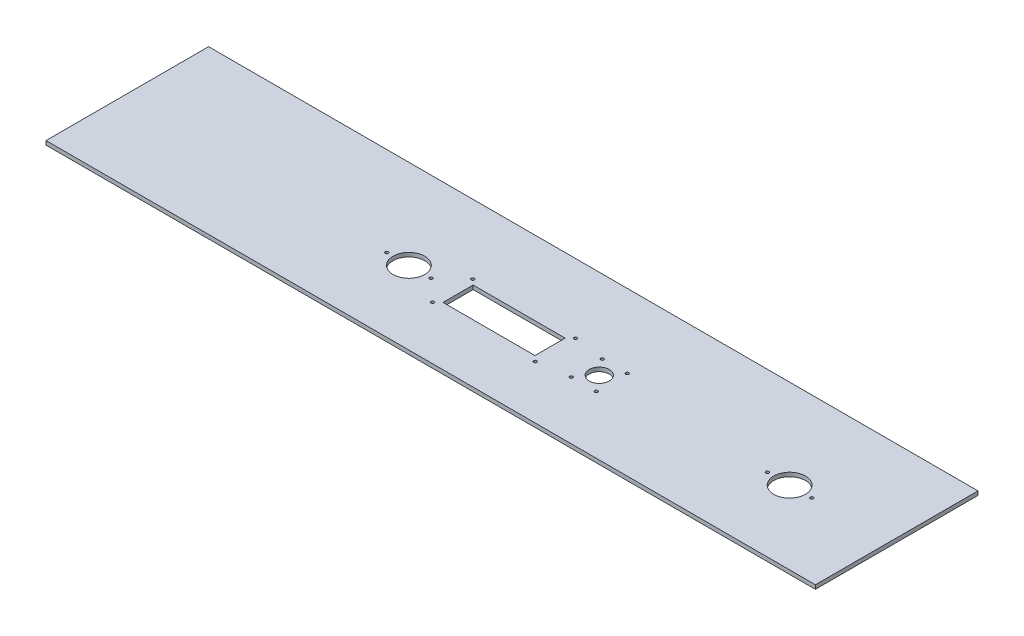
ISO-10303-21;
HEADER;
FILE_DESCRIPTION(('STEP AP214'),'2;1');
FILE_NAME('part.step','',(''),(''),'','','');
FILE_SCHEMA(('AUTOMOTIVE_DESIGN { 1 0 10303 214 1 1 1 1 }'));
ENDSEC;
DATA;
#1=APPLICATION_CONTEXT('core data for automotive mechanical design processes');
#2=APPLICATION_PROTOCOL_DEFINITION('international standard','automotive_design',2000,#1);
#3=PRODUCT_CONTEXT('',#1,'mechanical');
#4=PRODUCT('Part','Part','',(#3));
#5=PRODUCT_RELATED_PRODUCT_CATEGORY('part','',(#4));
#6=PRODUCT_DEFINITION_FORMATION('','',#4);
#7=PRODUCT_DEFINITION_CONTEXT('part definition',#1,'design');
#8=PRODUCT_DEFINITION('design','',#6,#7);
#9=PRODUCT_DEFINITION_SHAPE('','',#8);
#10=(LENGTH_UNIT() NAMED_UNIT(*) SI_UNIT(.MILLI.,.METRE.));
#11=(NAMED_UNIT(*) PLANE_ANGLE_UNIT() SI_UNIT($,.RADIAN.));
#12=(NAMED_UNIT(*) SI_UNIT($,.STERADIAN.) SOLID_ANGLE_UNIT());
#13=UNCERTAINTY_MEASURE_WITH_UNIT(LENGTH_MEASURE(1.E-05),#10,'distance_accuracy_value','');
#14=(GEOMETRIC_REPRESENTATION_CONTEXT(3) GLOBAL_UNCERTAINTY_ASSIGNED_CONTEXT((#13)) GLOBAL_UNIT_ASSIGNED_CONTEXT((#10,
#11,#12)) REPRESENTATION_CONTEXT('',''));
#15=CARTESIAN_POINT('',(0.,0.,0.));
#16=DIRECTION('',(0.,0.,1.));
#17=DIRECTION('',(1.,0.,0.));
#18=AXIS2_PLACEMENT_3D('',#15,#16,#17);
#19=CARTESIAN_POINT('',(307.975,3.175,65.0875));
#20=DIRECTION('',(-1.,0.,0.));
#21=DIRECTION('',(0.,0.,1.));
#22=AXIS2_PLACEMENT_3D('',#19,#20,#21);
#23=PLANE('',#22);
#24=DIRECTION('',(0.,0.,-1.));
#25=VECTOR('',#24,1.);
#26=CARTESIAN_POINT('',(307.975,0.,65.0875));
#27=LINE('',#26,#25);
#28=CARTESIAN_POINT('',(307.975,0.,65.0875));
#29=VERTEX_POINT('',#28);
#30=CARTESIAN_POINT('',(307.975,0.,-65.0875));
#31=VERTEX_POINT('',#30);
#32=EDGE_CURVE('E158',#29,#31,#27,.T.);
#33=ORIENTED_EDGE('',*,*,#32,.T.);
#34=DIRECTION('',(0.,-1.,0.));
#35=VECTOR('',#34,1.);
#36=CARTESIAN_POINT('',(307.975,3.175,-65.0875));
#37=LINE('',#36,#35);
#38=CARTESIAN_POINT('',(307.975,3.175,-65.0875));
#39=VERTEX_POINT('',#38);
#40=EDGE_CURVE('E12',#39,#31,#37,.T.);
#41=ORIENTED_EDGE('',*,*,#40,.F.);
#42=DIRECTION('',(0.,0.,-1.));
#43=VECTOR('',#42,1.);
#44=CARTESIAN_POINT('',(307.975,3.175,65.0875));
#45=LINE('',#44,#43);
#46=CARTESIAN_POINT('',(307.975,3.175,65.0875));
#47=VERTEX_POINT('',#46);
#48=EDGE_CURVE('E162',#47,#39,#45,.T.);
#49=ORIENTED_EDGE('',*,*,#48,.F.);
#50=DIRECTION('',(0.,-1.,0.));
#51=VECTOR('',#50,1.);
#52=CARTESIAN_POINT('',(307.975,3.175,65.0875));
#53=LINE('',#52,#51);
#54=EDGE_CURVE('E179',#47,#29,#53,.T.);
#55=ORIENTED_EDGE('',*,*,#54,.T.);
#56=EDGE_LOOP('',(#33,#41,#49,#55));
#57=FACE_BOUND('',#56,.T.);
#58=ADVANCED_FACE('F46',(#57),#23,.F.);
#59=CARTESIAN_POINT('',(-307.975,3.175,-65.0875));
#60=DIRECTION('',(0.,0.,1.));
#61=DIRECTION('',(1.,0.,0.));
#62=AXIS2_PLACEMENT_3D('',#59,#60,#61);
#63=PLANE('',#62);
#64=DIRECTION('',(-1.,0.,0.));
#65=VECTOR('',#64,1.);
#66=CARTESIAN_POINT('',(-307.975,0.,-65.0875));
#67=LINE('',#66,#65);
#68=CARTESIAN_POINT('',(-307.975,0.,-65.0875));
#69=VERTEX_POINT('',#68);
#70=EDGE_CURVE('E182',#31,#69,#67,.T.);
#71=ORIENTED_EDGE('',*,*,#70,.T.);
#72=DIRECTION('',(0.,-1.,0.));
#73=VECTOR('',#72,1.);
#74=CARTESIAN_POINT('',(-307.975,3.175,-65.0875));
#75=LINE('',#74,#73);
#76=CARTESIAN_POINT('',(-307.975,3.175,-65.0875));
#77=VERTEX_POINT('',#76);
#78=EDGE_CURVE('E53',#77,#69,#75,.T.);
#79=ORIENTED_EDGE('',*,*,#78,.F.);
#80=DIRECTION('',(-1.,0.,0.));
#81=VECTOR('',#80,1.);
#82=CARTESIAN_POINT('',(-307.975,3.175,-65.0875));
#83=LINE('',#82,#81);
#84=EDGE_CURVE('E167',#39,#77,#83,.T.);
#85=ORIENTED_EDGE('',*,*,#84,.F.);
#86=ORIENTED_EDGE('',*,*,#40,.T.);
#87=EDGE_LOOP('',(#71,#79,#85,#86));
#88=FACE_BOUND('',#87,.T.);
#89=ADVANCED_FACE('F367',(#88),#63,.F.);
#90=CARTESIAN_POINT('',(-307.975,3.175,65.0875));
#91=DIRECTION('',(1.,0.,0.));
#92=DIRECTION('',(0.,0.,-1.));
#93=AXIS2_PLACEMENT_3D('',#90,#91,#92);
#94=PLANE('',#93);
#95=DIRECTION('',(0.,0.,1.));
#96=VECTOR('',#95,1.);
#97=CARTESIAN_POINT('',(-307.975,0.,65.0875));
#98=LINE('',#97,#96);
#99=CARTESIAN_POINT('',(-307.975,0.,65.0875));
#100=VERTEX_POINT('',#99);
#101=EDGE_CURVE('E184',#69,#100,#98,.T.);
#102=ORIENTED_EDGE('',*,*,#101,.T.);
#103=DIRECTION('',(0.,-1.,0.));
#104=VECTOR('',#103,1.);
#105=CARTESIAN_POINT('',(-307.975,3.175,65.0875));
#106=LINE('',#105,#104);
#107=CARTESIAN_POINT('',(-307.975,3.175,65.0875));
#108=VERTEX_POINT('',#107);
#109=EDGE_CURVE('E189',#108,#100,#106,.T.);
#110=ORIENTED_EDGE('',*,*,#109,.F.);
#111=DIRECTION('',(0.,0.,1.));
#112=VECTOR('',#111,1.);
#113=CARTESIAN_POINT('',(-307.975,3.175,65.0875));
#114=LINE('',#113,#112);
#115=EDGE_CURVE('E172',#77,#108,#114,.T.);
#116=ORIENTED_EDGE('',*,*,#115,.F.);
#117=ORIENTED_EDGE('',*,*,#78,.T.);
#118=EDGE_LOOP('',(#102,#110,#116,#117));
#119=FACE_BOUND('',#118,.T.);
#120=ADVANCED_FACE('F196',(#119),#94,.F.);
#121=CARTESIAN_POINT('',(-307.975,3.175,65.0875));
#122=DIRECTION('',(0.,0.,-1.));
#123=DIRECTION('',(-1.,0.,0.));
#124=AXIS2_PLACEMENT_3D('',#121,#122,#123);
#125=PLANE('',#124);
#126=DIRECTION('',(1.,0.,0.));
#127=VECTOR('',#126,1.);
#128=CARTESIAN_POINT('',(-307.975,0.,65.0875));
#129=LINE('',#128,#127);
#130=EDGE_CURVE('E168',#100,#29,#129,.T.);
#131=ORIENTED_EDGE('',*,*,#130,.T.);
#132=ORIENTED_EDGE('',*,*,#54,.F.);
#133=DIRECTION('',(1.,0.,0.));
#134=VECTOR('',#133,1.);
#135=CARTESIAN_POINT('',(-307.975,3.175,65.0875));
#136=LINE('',#135,#134);
#137=EDGE_CURVE('E175',#108,#47,#136,.T.);
#138=ORIENTED_EDGE('',*,*,#137,.F.);
#139=ORIENTED_EDGE('',*,*,#109,.T.);
#140=EDGE_LOOP('',(#131,#132,#138,#139));
#141=FACE_BOUND('',#140,.T.);
#142=ADVANCED_FACE('F203',(#141),#125,.F.);
#143=CARTESIAN_POINT('',(0.,3.175,0.));
#144=DIRECTION('',(0.,-1.,0.));
#145=DIRECTION('',(0.,0.,-1.));
#146=AXIS2_PLACEMENT_3D('',#143,#144,#145);
#147=PLANE('',#146);
#148=CARTESIAN_POINT('',(86.2,3.175,18.85));
#149=DIRECTION('',(0.,1.,0.));
#150=DIRECTION('',(0.,0.,1.));
#151=AXIS2_PLACEMENT_3D('',#148,#149,#150);
#152=CIRCLE('',#151,1.25);
#153=CARTESIAN_POINT('',(86.2,3.175,20.1));
#154=VERTEX_POINT('',#153);
#155=EDGE_CURVE('E283',#154,#154,#152,.T.);
#156=ORIENTED_EDGE('',*,*,#155,.F.);
#157=EDGE_LOOP('',(#156));
#158=FACE_BOUND('',#157,.T.);
#159=CARTESIAN_POINT('',(-58.42,3.175,6.35));
#160=DIRECTION('',(0.,1.,0.));
#161=DIRECTION('',(0.,0.,1.));
#162=AXIS2_PLACEMENT_3D('',#159,#160,#161);
#163=CIRCLE('',#162,1.25);
#164=CARTESIAN_POINT('',(-58.42,3.175,7.60000000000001));
#165=VERTEX_POINT('',#164);
#166=EDGE_CURVE('E278',#165,#165,#163,.T.);
#167=ORIENTED_EDGE('',*,*,#166,.F.);
#168=EDGE_LOOP('',(#167));
#169=FACE_BOUND('',#168,.T.);
#170=CARTESIAN_POINT('',(-93.98,3.175,6.35));
#171=DIRECTION('',(0.,1.,0.));
#172=DIRECTION('',(0.,0.,1.));
#173=AXIS2_PLACEMENT_3D('',#170,#171,#172);
#174=CIRCLE('',#173,1.25);
#175=CARTESIAN_POINT('',(-93.98,3.175,7.6));
#176=VERTEX_POINT('',#175);
#177=EDGE_CURVE('E273',#176,#176,#174,.T.);
#178=ORIENTED_EDGE('',*,*,#177,.F.);
#179=EDGE_LOOP('',(#178));
#180=FACE_BOUND('',#179,.T.);
#181=CARTESIAN_POINT('',(-76.2,3.175,6.35));
#182=DIRECTION('',(0.,1.,0.));
#183=DIRECTION('',(0.,0.,1.));
#184=AXIS2_PLACEMENT_3D('',#181,#182,#183);
#185=CIRCLE('',#184,12.7);
#186=CARTESIAN_POINT('',(-76.2,3.175,19.05));
#187=VERTEX_POINT('',#186);
#188=EDGE_CURVE('E268',#187,#187,#185,.T.);
#189=ORIENTED_EDGE('',*,*,#188,.F.);
#190=EDGE_LOOP('',(#189));
#191=FACE_BOUND('',#190,.T.);
#192=CARTESIAN_POINT('',(-41.099999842,3.175,-9.69999990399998));
#193=DIRECTION('',(0.,1.,0.));
#194=DIRECTION('',(0.,0.,-1.));
#195=AXIS2_PLACEMENT_3D('',#192,#193,#194);
#196=CIRCLE('',#195,1.25);
#197=CARTESIAN_POINT('',(-41.099999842,3.175,-10.949999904));
#198=VERTEX_POINT('',#197);
#199=EDGE_CURVE('E265',#198,#198,#196,.T.);
#200=ORIENTED_EDGE('',*,*,#199,.F.);
#201=EDGE_LOOP('',(#200));
#202=FACE_BOUND('',#201,.T.);
#203=CARTESIAN_POINT('',(-41.099999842,3.175,22.399999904));
#204=DIRECTION('',(0.,1.,0.));
#205=DIRECTION('',(0.,0.,1.));
#206=AXIS2_PLACEMENT_3D('',#203,#204,#205);
#207=CIRCLE('',#206,1.25);
#208=CARTESIAN_POINT('',(-41.099999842,3.175,23.649999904));
#209=VERTEX_POINT('',#208);
#210=EDGE_CURVE('E260',#209,#209,#207,.T.);
#211=ORIENTED_EDGE('',*,*,#210,.F.);
#212=EDGE_LOOP('',(#211));
#213=FACE_BOUND('',#212,.T.);
#214=CARTESIAN_POINT('',(41.099999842,3.175,22.399999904));
#215=DIRECTION('',(0.,1.,0.));
#216=DIRECTION('',(0.,0.,-1.));
#217=AXIS2_PLACEMENT_3D('',#214,#215,#216);
#218=CIRCLE('',#217,1.25);
#219=CARTESIAN_POINT('',(41.099999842,3.175,21.149999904));
#220=VERTEX_POINT('',#219);
#221=EDGE_CURVE('E255',#220,#220,#218,.T.);
#222=ORIENTED_EDGE('',*,*,#221,.F.);
#223=EDGE_LOOP('',(#222));
#224=FACE_BOUND('',#223,.T.);
#225=CARTESIAN_POINT('',(41.099999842,3.175,-9.69999990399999));
#226=DIRECTION('',(0.,1.,0.));
#227=DIRECTION('',(0.,0.,1.));
#228=AXIS2_PLACEMENT_3D('',#225,#226,#227);
#229=CIRCLE('',#228,1.25);
#230=CARTESIAN_POINT('',(41.099999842,3.175,-8.449999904));
#231=VERTEX_POINT('',#230);
#232=EDGE_CURVE('E144',#231,#231,#229,.T.);
#233=ORIENTED_EDGE('',*,*,#232,.F.);
#234=EDGE_LOOP('',(#233));
#235=FACE_BOUND('',#234,.T.);
#236=CARTESIAN_POINT('',(76.2,3.175,6.35));
#237=DIRECTION('',(0.,1.,0.));
#238=DIRECTION('',(0.,0.,1.));
#239=AXIS2_PLACEMENT_3D('',#236,#237,#238);
#240=CIRCLE('',#239,8.00000000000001);
#241=CARTESIAN_POINT('',(76.2,3.175,14.35));
#242=VERTEX_POINT('',#241);
#243=EDGE_CURVE('E247',#242,#242,#240,.T.);
#244=ORIENTED_EDGE('',*,*,#243,.F.);
#245=EDGE_LOOP('',(#244));
#246=FACE_BOUND('',#245,.T.);
#247=CARTESIAN_POINT('',(66.2,3.175,-6.15));
#248=DIRECTION('',(0.,1.,0.));
#249=DIRECTION('',(0.,0.,1.));
#250=AXIS2_PLACEMENT_3D('',#247,#248,#249);
#251=CIRCLE('',#250,1.25);
#252=CARTESIAN_POINT('',(66.2,3.175,-4.9));
#253=VERTEX_POINT('',#252);
#254=EDGE_CURVE('E242',#253,#253,#251,.T.);
#255=ORIENTED_EDGE('',*,*,#254,.F.);
#256=EDGE_LOOP('',(#255));
#257=FACE_BOUND('',#256,.T.);
#258=CARTESIAN_POINT('',(66.2,3.175,18.85));
#259=DIRECTION('',(0.,1.,0.));
#260=DIRECTION('',(0.,0.,1.));
#261=AXIS2_PLACEMENT_3D('',#258,#259,#260);
#262=CIRCLE('',#261,1.25);
#263=CARTESIAN_POINT('',(66.2,3.175,20.1));
#264=VERTEX_POINT('',#263);
#265=EDGE_CURVE('E237',#264,#264,#262,.T.);
#266=ORIENTED_EDGE('',*,*,#265,.F.);
#267=EDGE_LOOP('',(#266));
#268=FACE_BOUND('',#267,.T.);
#269=CARTESIAN_POINT('',(86.2,3.175,-6.15));
#270=DIRECTION('',(0.,1.,0.));
#271=DIRECTION('',(0.,0.,1.));
#272=AXIS2_PLACEMENT_3D('',#269,#270,#271);
#273=CIRCLE('',#272,1.25);
#274=CARTESIAN_POINT('',(86.2,3.175,-4.9));
#275=VERTEX_POINT('',#274);
#276=EDGE_CURVE('E231',#275,#275,#273,.T.);
#277=ORIENTED_EDGE('',*,*,#276,.F.);
#278=EDGE_LOOP('',(#277));
#279=FACE_BOUND('',#278,.T.);
#280=CARTESIAN_POINT('',(228.6,3.175,6.34999999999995));
#281=DIRECTION('',(0.,1.,0.));
#282=DIRECTION('',(0.,0.,-1.));
#283=AXIS2_PLACEMENT_3D('',#280,#281,#282);
#284=CIRCLE('',#283,12.7);
#285=CARTESIAN_POINT('',(228.6,3.175,-6.3500000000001));
#286=VERTEX_POINT('',#285);
#287=EDGE_CURVE('E226',#286,#286,#284,.T.);
#288=ORIENTED_EDGE('',*,*,#287,.F.);
#289=EDGE_LOOP('',(#288));
#290=FACE_BOUND('',#289,.T.);
#291=CARTESIAN_POINT('',(210.82,3.175,6.34999999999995));
#292=DIRECTION('',(0.,1.,0.));
#293=DIRECTION('',(0.,0.,-1.));
#294=AXIS2_PLACEMENT_3D('',#291,#292,#293);
#295=CIRCLE('',#294,1.25000000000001);
#296=CARTESIAN_POINT('',(210.82,3.175,5.09999999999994));
#297=VERTEX_POINT('',#296);
#298=EDGE_CURVE('E221',#297,#297,#295,.T.);
#299=ORIENTED_EDGE('',*,*,#298,.F.);
#300=EDGE_LOOP('',(#299));
#301=FACE_BOUND('',#300,.T.);
#302=CARTESIAN_POINT('',(246.38,3.175,6.34999999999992));
#303=DIRECTION('',(0.,1.,0.));
#304=DIRECTION('',(0.,0.,-1.));
#305=AXIS2_PLACEMENT_3D('',#302,#303,#304);
#306=CIRCLE('',#305,1.25000000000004);
#307=CARTESIAN_POINT('',(246.38,3.175,5.09999999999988));
#308=VERTEX_POINT('',#307);
#309=EDGE_CURVE('E215',#308,#308,#306,.T.);
#310=ORIENTED_EDGE('',*,*,#309,.F.);
#311=EDGE_LOOP('',(#310));
#312=FACE_BOUND('',#311,.T.);
#313=DIRECTION('',(-1.,0.,0.));
#314=VECTOR('',#313,1.);
#315=CARTESIAN_POINT('',(-36.83,3.175,-5.715));
#316=LINE('',#315,#314);
#317=CARTESIAN_POINT('',(36.83,3.175,-5.715));
#318=VERTEX_POINT('',#317);
#319=CARTESIAN_POINT('',(-36.83,3.175,-5.715));
#320=VERTEX_POINT('',#319);
#321=EDGE_CURVE('E143',#318,#320,#316,.T.);
#322=ORIENTED_EDGE('',*,*,#321,.F.);
#323=DIRECTION('',(0.,0.,-1.));
#324=VECTOR('',#323,1.);
#325=CARTESIAN_POINT('',(36.83,3.175,18.415));
#326=LINE('',#325,#324);
#327=CARTESIAN_POINT('',(36.83,3.175,18.415));
#328=VERTEX_POINT('',#327);
#329=EDGE_CURVE('E60',#328,#318,#326,.T.);
#330=ORIENTED_EDGE('',*,*,#329,.F.);
#331=DIRECTION('',(1.,0.,0.));
#332=VECTOR('',#331,1.);
#333=CARTESIAN_POINT('',(-36.83,3.175,18.415));
#334=LINE('',#333,#332);
#335=CARTESIAN_POINT('',(-36.83,3.175,18.415));
#336=VERTEX_POINT('',#335);
#337=EDGE_CURVE('E128',#336,#328,#334,.T.);
#338=ORIENTED_EDGE('',*,*,#337,.F.);
#339=DIRECTION('',(0.,0.,1.));
#340=VECTOR('',#339,1.);
#341=CARTESIAN_POINT('',(-36.83,3.175,18.415));
#342=LINE('',#341,#340);
#343=EDGE_CURVE('E132',#320,#336,#342,.T.);
#344=ORIENTED_EDGE('',*,*,#343,.F.);
#345=EDGE_LOOP('',(#322,#330,#338,#344));
#346=FACE_BOUND('',#345,.T.);
#347=ORIENTED_EDGE('',*,*,#48,.T.);
#348=ORIENTED_EDGE('',*,*,#84,.T.);
#349=ORIENTED_EDGE('',*,*,#115,.T.);
#350=ORIENTED_EDGE('',*,*,#137,.T.);
#351=EDGE_LOOP('',(#347,#348,#349,#350));
#352=FACE_BOUND('',#351,.T.);
#353=ADVANCED_FACE('F209',(#158,#169,#180,#191,#202,#213,#224,#235,#246,#257,#268,#279,#290,
#301,#312,#346,#352),#147,.F.);
#354=CARTESIAN_POINT('',(0.,0.,0.));
#355=DIRECTION('',(0.,-1.,0.));
#356=DIRECTION('',(0.,0.,-1.));
#357=AXIS2_PLACEMENT_3D('',#354,#355,#356);
#358=PLANE('',#357);
#359=CARTESIAN_POINT('',(86.2,0.,18.85));
#360=DIRECTION('',(0.,1.,0.));
#361=DIRECTION('',(0.,0.,1.));
#362=AXIS2_PLACEMENT_3D('',#359,#360,#361);
#363=CIRCLE('',#362,1.25);
#364=CARTESIAN_POINT('',(86.2,0.,20.1));
#365=VERTEX_POINT('',#364);
#366=EDGE_CURVE('E234',#365,#365,#363,.T.);
#367=ORIENTED_EDGE('',*,*,#366,.T.);
#368=EDGE_LOOP('',(#367));
#369=FACE_BOUND('',#368,.T.);
#370=CARTESIAN_POINT('',(-58.42,0.,6.35));
#371=DIRECTION('',(0.,1.,0.));
#372=DIRECTION('',(0.,0.,1.));
#373=AXIS2_PLACEMENT_3D('',#370,#371,#372);
#374=CIRCLE('',#373,1.25);
#375=CARTESIAN_POINT('',(-58.42,0.,7.60000000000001));
#376=VERTEX_POINT('',#375);
#377=EDGE_CURVE('E281',#376,#376,#374,.T.);
#378=ORIENTED_EDGE('',*,*,#377,.T.);
#379=EDGE_LOOP('',(#378));
#380=FACE_BOUND('',#379,.T.);
#381=CARTESIAN_POINT('',(-93.98,0.,6.35));
#382=DIRECTION('',(0.,1.,0.));
#383=DIRECTION('',(0.,0.,1.));
#384=AXIS2_PLACEMENT_3D('',#381,#382,#383);
#385=CIRCLE('',#384,1.25);
#386=CARTESIAN_POINT('',(-93.98,0.,7.6));
#387=VERTEX_POINT('',#386);
#388=EDGE_CURVE('E276',#387,#387,#385,.T.);
#389=ORIENTED_EDGE('',*,*,#388,.T.);
#390=EDGE_LOOP('',(#389));
#391=FACE_BOUND('',#390,.T.);
#392=CARTESIAN_POINT('',(-76.2,0.,6.35));
#393=DIRECTION('',(0.,1.,0.));
#394=DIRECTION('',(0.,0.,1.));
#395=AXIS2_PLACEMENT_3D('',#392,#393,#394);
#396=CIRCLE('',#395,12.7);
#397=CARTESIAN_POINT('',(-76.2,0.,19.05));
#398=VERTEX_POINT('',#397);
#399=EDGE_CURVE('E271',#398,#398,#396,.T.);
#400=ORIENTED_EDGE('',*,*,#399,.T.);
#401=EDGE_LOOP('',(#400));
#402=FACE_BOUND('',#401,.T.);
#403=CARTESIAN_POINT('',(-41.099999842,0.,-9.69999990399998));
#404=DIRECTION('',(0.,1.,0.));
#405=DIRECTION('',(0.,0.,-1.));
#406=AXIS2_PLACEMENT_3D('',#403,#404,#405);
#407=CIRCLE('',#406,1.25);
#408=CARTESIAN_POINT('',(-41.099999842,0.,-10.949999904));
#409=VERTEX_POINT('',#408);
#410=EDGE_CURVE('E135',#409,#409,#407,.T.);
#411=ORIENTED_EDGE('',*,*,#410,.T.);
#412=EDGE_LOOP('',(#411));
#413=FACE_BOUND('',#412,.T.);
#414=CARTESIAN_POINT('',(-41.099999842,0.,22.399999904));
#415=DIRECTION('',(0.,1.,0.));
#416=DIRECTION('',(0.,0.,1.));
#417=AXIS2_PLACEMENT_3D('',#414,#415,#416);
#418=CIRCLE('',#417,1.25);
#419=CARTESIAN_POINT('',(-41.099999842,0.,23.649999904));
#420=VERTEX_POINT('',#419);
#421=EDGE_CURVE('E263',#420,#420,#418,.T.);
#422=ORIENTED_EDGE('',*,*,#421,.T.);
#423=EDGE_LOOP('',(#422));
#424=FACE_BOUND('',#423,.T.);
#425=CARTESIAN_POINT('',(41.099999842,0.,22.399999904));
#426=DIRECTION('',(0.,1.,0.));
#427=DIRECTION('',(0.,0.,-1.));
#428=AXIS2_PLACEMENT_3D('',#425,#426,#427);
#429=CIRCLE('',#428,1.25);
#430=CARTESIAN_POINT('',(41.099999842,0.,21.149999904));
#431=VERTEX_POINT('',#430);
#432=EDGE_CURVE('E258',#431,#431,#429,.T.);
#433=ORIENTED_EDGE('',*,*,#432,.T.);
#434=EDGE_LOOP('',(#433));
#435=FACE_BOUND('',#434,.T.);
#436=CARTESIAN_POINT('',(41.099999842,0.,-9.69999990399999));
#437=DIRECTION('',(0.,1.,0.));
#438=DIRECTION('',(0.,0.,1.));
#439=AXIS2_PLACEMENT_3D('',#436,#437,#438);
#440=CIRCLE('',#439,1.25);
#441=CARTESIAN_POINT('',(41.099999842,0.,-8.449999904));
#442=VERTEX_POINT('',#441);
#443=EDGE_CURVE('E253',#442,#442,#440,.T.);
#444=ORIENTED_EDGE('',*,*,#443,.T.);
#445=EDGE_LOOP('',(#444));
#446=FACE_BOUND('',#445,.T.);
#447=CARTESIAN_POINT('',(76.2,0.,6.35));
#448=DIRECTION('',(0.,1.,0.));
#449=DIRECTION('',(0.,0.,1.));
#450=AXIS2_PLACEMENT_3D('',#447,#448,#449);
#451=CIRCLE('',#450,8.00000000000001);
#452=CARTESIAN_POINT('',(76.2,0.,14.35));
#453=VERTEX_POINT('',#452);
#454=EDGE_CURVE('E218',#453,#453,#451,.T.);
#455=ORIENTED_EDGE('',*,*,#454,.T.);
#456=EDGE_LOOP('',(#455));
#457=FACE_BOUND('',#456,.T.);
#458=CARTESIAN_POINT('',(66.2,0.,-6.15));
#459=DIRECTION('',(0.,1.,0.));
#460=DIRECTION('',(0.,0.,1.));
#461=AXIS2_PLACEMENT_3D('',#458,#459,#460);
#462=CIRCLE('',#461,1.25);
#463=CARTESIAN_POINT('',(66.2,0.,-4.9));
#464=VERTEX_POINT('',#463);
#465=EDGE_CURVE('E245',#464,#464,#462,.T.);
#466=ORIENTED_EDGE('',*,*,#465,.T.);
#467=EDGE_LOOP('',(#466));
#468=FACE_BOUND('',#467,.T.);
#469=CARTESIAN_POINT('',(66.2,0.,18.85));
#470=DIRECTION('',(0.,1.,0.));
#471=DIRECTION('',(0.,0.,1.));
#472=AXIS2_PLACEMENT_3D('',#469,#470,#471);
#473=CIRCLE('',#472,1.25);
#474=CARTESIAN_POINT('',(66.2,0.,20.1));
#475=VERTEX_POINT('',#474);
#476=EDGE_CURVE('E240',#475,#475,#473,.T.);
#477=ORIENTED_EDGE('',*,*,#476,.T.);
#478=EDGE_LOOP('',(#477));
#479=FACE_BOUND('',#478,.T.);
#480=CARTESIAN_POINT('',(86.2,0.,-6.15));
#481=DIRECTION('',(0.,1.,0.));
#482=DIRECTION('',(0.,0.,1.));
#483=AXIS2_PLACEMENT_3D('',#480,#481,#482);
#484=CIRCLE('',#483,1.25);
#485=CARTESIAN_POINT('',(86.2,0.,-4.9));
#486=VERTEX_POINT('',#485);
#487=EDGE_CURVE('E235',#486,#486,#484,.T.);
#488=ORIENTED_EDGE('',*,*,#487,.T.);
#489=EDGE_LOOP('',(#488));
#490=FACE_BOUND('',#489,.T.);
#491=CARTESIAN_POINT('',(228.6,0.,6.34999999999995));
#492=DIRECTION('',(0.,1.,0.));
#493=DIRECTION('',(0.,0.,-1.));
#494=AXIS2_PLACEMENT_3D('',#491,#492,#493);
#495=CIRCLE('',#494,12.7);
#496=CARTESIAN_POINT('',(228.6,0.,-6.3500000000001));
#497=VERTEX_POINT('',#496);
#498=EDGE_CURVE('E229',#497,#497,#495,.T.);
#499=ORIENTED_EDGE('',*,*,#498,.T.);
#500=EDGE_LOOP('',(#499));
#501=FACE_BOUND('',#500,.T.);
#502=CARTESIAN_POINT('',(210.82,0.,6.34999999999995));
#503=DIRECTION('',(0.,1.,0.));
#504=DIRECTION('',(0.,0.,-1.));
#505=AXIS2_PLACEMENT_3D('',#502,#503,#504);
#506=CIRCLE('',#505,1.25000000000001);
#507=CARTESIAN_POINT('',(210.82,0.,5.09999999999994));
#508=VERTEX_POINT('',#507);
#509=EDGE_CURVE('E224',#508,#508,#506,.T.);
#510=ORIENTED_EDGE('',*,*,#509,.T.);
#511=EDGE_LOOP('',(#510));
#512=FACE_BOUND('',#511,.T.);
#513=CARTESIAN_POINT('',(246.38,0.,6.34999999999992));
#514=DIRECTION('',(0.,1.,0.));
#515=DIRECTION('',(0.,0.,-1.));
#516=AXIS2_PLACEMENT_3D('',#513,#514,#515);
#517=CIRCLE('',#516,1.25000000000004);
#518=CARTESIAN_POINT('',(246.38,0.,5.09999999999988));
#519=VERTEX_POINT('',#518);
#520=EDGE_CURVE('E219',#519,#519,#517,.T.);
#521=ORIENTED_EDGE('',*,*,#520,.T.);
#522=EDGE_LOOP('',(#521));
#523=FACE_BOUND('',#522,.T.);
#524=DIRECTION('',(0.,0.,-1.));
#525=VECTOR('',#524,1.);
#526=CARTESIAN_POINT('',(36.83,0.,18.415));
#527=LINE('',#526,#525);
#528=CARTESIAN_POINT('',(36.83,0.,18.415));
#529=VERTEX_POINT('',#528);
#530=CARTESIAN_POINT('',(36.83,0.,-5.715));
#531=VERTEX_POINT('',#530);
#532=EDGE_CURVE('E112',#529,#531,#527,.T.);
#533=ORIENTED_EDGE('',*,*,#532,.T.);
#534=DIRECTION('',(-1.,0.,0.));
#535=VECTOR('',#534,1.);
#536=CARTESIAN_POINT('',(-36.83,0.,-5.715));
#537=LINE('',#536,#535);
#538=CARTESIAN_POINT('',(-36.83,0.,-5.715));
#539=VERTEX_POINT('',#538);
#540=EDGE_CURVE('E121',#531,#539,#537,.T.);
#541=ORIENTED_EDGE('',*,*,#540,.T.);
#542=DIRECTION('',(0.,0.,1.));
#543=VECTOR('',#542,1.);
#544=CARTESIAN_POINT('',(-36.83,0.,18.415));
#545=LINE('',#544,#543);
#546=CARTESIAN_POINT('',(-36.83,0.,18.415));
#547=VERTEX_POINT('',#546);
#548=EDGE_CURVE('E68',#539,#547,#545,.T.);
#549=ORIENTED_EDGE('',*,*,#548,.T.);
#550=DIRECTION('',(1.,0.,0.));
#551=VECTOR('',#550,1.);
#552=CARTESIAN_POINT('',(-36.83,0.,18.415));
#553=LINE('',#552,#551);
#554=EDGE_CURVE('E118',#547,#529,#553,.T.);
#555=ORIENTED_EDGE('',*,*,#554,.T.);
#556=EDGE_LOOP('',(#533,#541,#549,#555));
#557=FACE_BOUND('',#556,.T.);
#558=ORIENTED_EDGE('',*,*,#32,.F.);
#559=ORIENTED_EDGE('',*,*,#130,.F.);
#560=ORIENTED_EDGE('',*,*,#101,.F.);
#561=ORIENTED_EDGE('',*,*,#70,.F.);
#562=EDGE_LOOP('',(#558,#559,#560,#561));
#563=FACE_BOUND('',#562,.T.);
#564=ADVANCED_FACE('F125',(#369,#380,#391,#402,#413,#424,#435,#446,#457,#468,#479,#490,#501,
#512,#523,#557,#563),#358,.T.);
#565=CARTESIAN_POINT('',(36.83,0.,18.415));
#566=DIRECTION('',(1.,0.,0.));
#567=DIRECTION('',(0.,0.,-1.));
#568=AXIS2_PLACEMENT_3D('',#565,#566,#567);
#569=PLANE('',#568);
#570=ORIENTED_EDGE('',*,*,#329,.T.);
#571=DIRECTION('',(0.,1.,0.));
#572=VECTOR('',#571,1.);
#573=CARTESIAN_POINT('',(36.83,0.,-5.715));
#574=LINE('',#573,#572);
#575=EDGE_CURVE('E108',#531,#318,#574,.T.);
#576=ORIENTED_EDGE('',*,*,#575,.F.);
#577=ORIENTED_EDGE('',*,*,#532,.F.);
#578=DIRECTION('',(0.,1.,0.));
#579=VECTOR('',#578,1.);
#580=CARTESIAN_POINT('',(36.83,0.,18.415));
#581=LINE('',#580,#579);
#582=EDGE_CURVE('E156',#529,#328,#581,.T.);
#583=ORIENTED_EDGE('',*,*,#582,.T.);
#584=EDGE_LOOP('',(#570,#576,#577,#583));
#585=FACE_BOUND('',#584,.T.);
#586=ADVANCED_FACE('F110',(#585),#569,.F.);
#587=CARTESIAN_POINT('',(-36.83,0.,18.415));
#588=DIRECTION('',(0.,0.,1.));
#589=DIRECTION('',(1.,0.,0.));
#590=AXIS2_PLACEMENT_3D('',#587,#588,#589);
#591=PLANE('',#590);
#592=ORIENTED_EDGE('',*,*,#337,.T.);
#593=ORIENTED_EDGE('',*,*,#582,.F.);
#594=ORIENTED_EDGE('',*,*,#554,.F.);
#595=DIRECTION('',(0.,1.,0.));
#596=VECTOR('',#595,1.);
#597=CARTESIAN_POINT('',(-36.83,0.,18.415));
#598=LINE('',#597,#596);
#599=EDGE_CURVE('E159',#547,#336,#598,.T.);
#600=ORIENTED_EDGE('',*,*,#599,.T.);
#601=EDGE_LOOP('',(#592,#593,#594,#600));
#602=FACE_BOUND('',#601,.T.);
#603=ADVANCED_FACE('F356',(#602),#591,.F.);
#604=CARTESIAN_POINT('',(-36.83,0.,18.415));
#605=DIRECTION('',(-1.,0.,0.));
#606=DIRECTION('',(0.,0.,1.));
#607=AXIS2_PLACEMENT_3D('',#604,#605,#606);
#608=PLANE('',#607);
#609=ORIENTED_EDGE('',*,*,#343,.T.);
#610=ORIENTED_EDGE('',*,*,#599,.F.);
#611=ORIENTED_EDGE('',*,*,#548,.F.);
#612=DIRECTION('',(0.,1.,0.));
#613=VECTOR('',#612,1.);
#614=CARTESIAN_POINT('',(-36.83,0.,-5.715));
#615=LINE('',#614,#613);
#616=EDGE_CURVE('E117',#539,#320,#615,.T.);
#617=ORIENTED_EDGE('',*,*,#616,.T.);
#618=EDGE_LOOP('',(#609,#610,#611,#617));
#619=FACE_BOUND('',#618,.T.);
#620=ADVANCED_FACE('F354',(#619),#608,.F.);
#621=CARTESIAN_POINT('',(-36.83,0.,-5.715));
#622=DIRECTION('',(0.,0.,-1.));
#623=DIRECTION('',(-1.,0.,0.));
#624=AXIS2_PLACEMENT_3D('',#621,#622,#623);
#625=PLANE('',#624);
#626=ORIENTED_EDGE('',*,*,#321,.T.);
#627=ORIENTED_EDGE('',*,*,#616,.F.);
#628=ORIENTED_EDGE('',*,*,#540,.F.);
#629=ORIENTED_EDGE('',*,*,#575,.T.);
#630=EDGE_LOOP('',(#626,#627,#628,#629));
#631=FACE_BOUND('',#630,.T.);
#632=ADVANCED_FACE('F122',(#631),#625,.F.);
#633=CARTESIAN_POINT('',(246.38,0.,6.34999999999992));
#634=DIRECTION('',(0.,1.,0.));
#635=DIRECTION('',(0.,0.,1.));
#636=AXIS2_PLACEMENT_3D('',#633,#634,#635);
#637=CYLINDRICAL_SURFACE('',#636,1.25000000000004);
#638=ORIENTED_EDGE('',*,*,#520,.F.);
#639=EDGE_LOOP('',(#638));
#640=FACE_BOUND('',#639,.T.);
#641=ORIENTED_EDGE('',*,*,#309,.T.);
#642=EDGE_LOOP('',(#641));
#643=FACE_BOUND('',#642,.T.);
#644=ADVANCED_FACE('F341',(#640,#643),#637,.F.);
#645=CARTESIAN_POINT('',(210.82,0.,6.34999999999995));
#646=DIRECTION('',(0.,1.,0.));
#647=DIRECTION('',(0.,0.,1.));
#648=AXIS2_PLACEMENT_3D('',#645,#646,#647);
#649=CYLINDRICAL_SURFACE('',#648,1.25000000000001);
#650=ORIENTED_EDGE('',*,*,#509,.F.);
#651=EDGE_LOOP('',(#650));
#652=FACE_BOUND('',#651,.T.);
#653=ORIENTED_EDGE('',*,*,#298,.T.);
#654=EDGE_LOOP('',(#653));
#655=FACE_BOUND('',#654,.T.);
#656=ADVANCED_FACE('F344',(#652,#655),#649,.F.);
#657=CARTESIAN_POINT('',(228.6,0.,6.34999999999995));
#658=DIRECTION('',(0.,1.,0.));
#659=DIRECTION('',(0.,0.,1.));
#660=AXIS2_PLACEMENT_3D('',#657,#658,#659);
#661=CYLINDRICAL_SURFACE('',#660,12.7);
#662=ORIENTED_EDGE('',*,*,#498,.F.);
#663=EDGE_LOOP('',(#662));
#664=FACE_BOUND('',#663,.T.);
#665=ORIENTED_EDGE('',*,*,#287,.T.);
#666=EDGE_LOOP('',(#665));
#667=FACE_BOUND('',#666,.T.);
#668=ADVANCED_FACE('F398',(#664,#667),#661,.F.);
#669=CARTESIAN_POINT('',(86.2,0.,-6.15));
#670=DIRECTION('',(0.,1.,0.));
#671=DIRECTION('',(0.,0.,1.));
#672=AXIS2_PLACEMENT_3D('',#669,#670,#671);
#673=CYLINDRICAL_SURFACE('',#672,1.25);
#674=ORIENTED_EDGE('',*,*,#487,.F.);
#675=EDGE_LOOP('',(#674));
#676=FACE_BOUND('',#675,.T.);
#677=ORIENTED_EDGE('',*,*,#276,.T.);
#678=EDGE_LOOP('',(#677));
#679=FACE_BOUND('',#678,.T.);
#680=ADVANCED_FACE('F407',(#676,#679),#673,.F.);
#681=CARTESIAN_POINT('',(66.2,0.,18.85));
#682=DIRECTION('',(0.,1.,0.));
#683=DIRECTION('',(0.,0.,1.));
#684=AXIS2_PLACEMENT_3D('',#681,#682,#683);
#685=CYLINDRICAL_SURFACE('',#684,1.25);
#686=ORIENTED_EDGE('',*,*,#476,.F.);
#687=EDGE_LOOP('',(#686));
#688=FACE_BOUND('',#687,.T.);
#689=ORIENTED_EDGE('',*,*,#265,.T.);
#690=EDGE_LOOP('',(#689));
#691=FACE_BOUND('',#690,.T.);
#692=ADVANCED_FACE('F416',(#688,#691),#685,.F.);
#693=CARTESIAN_POINT('',(66.2,0.,-6.15));
#694=DIRECTION('',(0.,1.,0.));
#695=DIRECTION('',(0.,0.,1.));
#696=AXIS2_PLACEMENT_3D('',#693,#694,#695);
#697=CYLINDRICAL_SURFACE('',#696,1.25);
#698=ORIENTED_EDGE('',*,*,#465,.F.);
#699=EDGE_LOOP('',(#698));
#700=FACE_BOUND('',#699,.T.);
#701=ORIENTED_EDGE('',*,*,#254,.T.);
#702=EDGE_LOOP('',(#701));
#703=FACE_BOUND('',#702,.T.);
#704=ADVANCED_FACE('F425',(#700,#703),#697,.F.);
#705=CARTESIAN_POINT('',(76.2,0.,6.35));
#706=DIRECTION('',(0.,1.,0.));
#707=DIRECTION('',(0.,0.,1.));
#708=AXIS2_PLACEMENT_3D('',#705,#706,#707);
#709=CYLINDRICAL_SURFACE('',#708,8.00000000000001);
#710=ORIENTED_EDGE('',*,*,#454,.F.);
#711=EDGE_LOOP('',(#710));
#712=FACE_BOUND('',#711,.T.);
#713=ORIENTED_EDGE('',*,*,#243,.T.);
#714=EDGE_LOOP('',(#713));
#715=FACE_BOUND('',#714,.T.);
#716=ADVANCED_FACE('F434',(#712,#715),#709,.F.);
#717=CARTESIAN_POINT('',(41.099999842,0.,-9.69999990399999));
#718=DIRECTION('',(0.,1.,0.));
#719=DIRECTION('',(0.,0.,1.));
#720=AXIS2_PLACEMENT_3D('',#717,#718,#719);
#721=CYLINDRICAL_SURFACE('',#720,1.25);
#722=ORIENTED_EDGE('',*,*,#443,.F.);
#723=EDGE_LOOP('',(#722));
#724=FACE_BOUND('',#723,.T.);
#725=ORIENTED_EDGE('',*,*,#232,.T.);
#726=EDGE_LOOP('',(#725));
#727=FACE_BOUND('',#726,.T.);
#728=ADVANCED_FACE('F443',(#724,#727),#721,.F.);
#729=CARTESIAN_POINT('',(41.099999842,0.,22.399999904));
#730=DIRECTION('',(0.,1.,0.));
#731=DIRECTION('',(0.,0.,1.));
#732=AXIS2_PLACEMENT_3D('',#729,#730,#731);
#733=CYLINDRICAL_SURFACE('',#732,1.25);
#734=ORIENTED_EDGE('',*,*,#432,.F.);
#735=EDGE_LOOP('',(#734));
#736=FACE_BOUND('',#735,.T.);
#737=ORIENTED_EDGE('',*,*,#221,.T.);
#738=EDGE_LOOP('',(#737));
#739=FACE_BOUND('',#738,.T.);
#740=ADVANCED_FACE('F452',(#736,#739),#733,.F.);
#741=CARTESIAN_POINT('',(-41.099999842,0.,22.399999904));
#742=DIRECTION('',(0.,1.,0.));
#743=DIRECTION('',(0.,0.,1.));
#744=AXIS2_PLACEMENT_3D('',#741,#742,#743);
#745=CYLINDRICAL_SURFACE('',#744,1.25);
#746=ORIENTED_EDGE('',*,*,#421,.F.);
#747=EDGE_LOOP('',(#746));
#748=FACE_BOUND('',#747,.T.);
#749=ORIENTED_EDGE('',*,*,#210,.T.);
#750=EDGE_LOOP('',(#749));
#751=FACE_BOUND('',#750,.T.);
#752=ADVANCED_FACE('F461',(#748,#751),#745,.F.);
#753=CARTESIAN_POINT('',(-41.099999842,0.,-9.69999990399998));
#754=DIRECTION('',(0.,1.,0.));
#755=DIRECTION('',(0.,0.,1.));
#756=AXIS2_PLACEMENT_3D('',#753,#754,#755);
#757=CYLINDRICAL_SURFACE('',#756,1.25);
#758=ORIENTED_EDGE('',*,*,#410,.F.);
#759=EDGE_LOOP('',(#758));
#760=FACE_BOUND('',#759,.T.);
#761=ORIENTED_EDGE('',*,*,#199,.T.);
#762=EDGE_LOOP('',(#761));
#763=FACE_BOUND('',#762,.T.);
#764=ADVANCED_FACE('F470',(#760,#763),#757,.F.);
#765=CARTESIAN_POINT('',(-76.2,0.,6.35));
#766=DIRECTION('',(0.,1.,0.));
#767=DIRECTION('',(0.,0.,1.));
#768=AXIS2_PLACEMENT_3D('',#765,#766,#767);
#769=CYLINDRICAL_SURFACE('',#768,12.7);
#770=ORIENTED_EDGE('',*,*,#399,.F.);
#771=EDGE_LOOP('',(#770));
#772=FACE_BOUND('',#771,.T.);
#773=ORIENTED_EDGE('',*,*,#188,.T.);
#774=EDGE_LOOP('',(#773));
#775=FACE_BOUND('',#774,.T.);
#776=ADVANCED_FACE('F479',(#772,#775),#769,.F.);
#777=CARTESIAN_POINT('',(-93.98,0.,6.35));
#778=DIRECTION('',(0.,1.,0.));
#779=DIRECTION('',(0.,0.,1.));
#780=AXIS2_PLACEMENT_3D('',#777,#778,#779);
#781=CYLINDRICAL_SURFACE('',#780,1.25);
#782=ORIENTED_EDGE('',*,*,#388,.F.);
#783=EDGE_LOOP('',(#782));
#784=FACE_BOUND('',#783,.T.);
#785=ORIENTED_EDGE('',*,*,#177,.T.);
#786=EDGE_LOOP('',(#785));
#787=FACE_BOUND('',#786,.T.);
#788=ADVANCED_FACE('F487',(#784,#787),#781,.F.);
#789=CARTESIAN_POINT('',(-58.42,0.,6.35));
#790=DIRECTION('',(0.,1.,0.));
#791=DIRECTION('',(0.,0.,1.));
#792=AXIS2_PLACEMENT_3D('',#789,#790,#791);
#793=CYLINDRICAL_SURFACE('',#792,1.25);
#794=ORIENTED_EDGE('',*,*,#377,.F.);
#795=EDGE_LOOP('',(#794));
#796=FACE_BOUND('',#795,.T.);
#797=ORIENTED_EDGE('',*,*,#166,.T.);
#798=EDGE_LOOP('',(#797));
#799=FACE_BOUND('',#798,.T.);
#800=ADVANCED_FACE('F496',(#796,#799),#793,.F.);
#801=CARTESIAN_POINT('',(86.2,0.,18.85));
#802=DIRECTION('',(0.,1.,0.));
#803=DIRECTION('',(0.,0.,1.));
#804=AXIS2_PLACEMENT_3D('',#801,#802,#803);
#805=CYLINDRICAL_SURFACE('',#804,1.25);
#806=ORIENTED_EDGE('',*,*,#366,.F.);
#807=EDGE_LOOP('',(#806));
#808=FACE_BOUND('',#807,.T.);
#809=ORIENTED_EDGE('',*,*,#155,.T.);
#810=EDGE_LOOP('',(#809));
#811=FACE_BOUND('',#810,.T.);
#812=ADVANCED_FACE('F505',(#808,#811),#805,.F.);
#813=CLOSED_SHELL('',(#58,#89,#120,#142,#353,#564,#586,#603,#620,#632,#644,#656,#668,#680,#692,
#704,#716,#728,#740,#752,#764,#776,#788,#800,#812));
#814=MANIFOLD_SOLID_BREP('B2',#813);
#815=ADVANCED_BREP_SHAPE_REPRESENTATION('',(#18,#814),#14);
#816=SHAPE_DEFINITION_REPRESENTATION(#9,#815);
ENDSEC;
END-ISO-10303-21;
